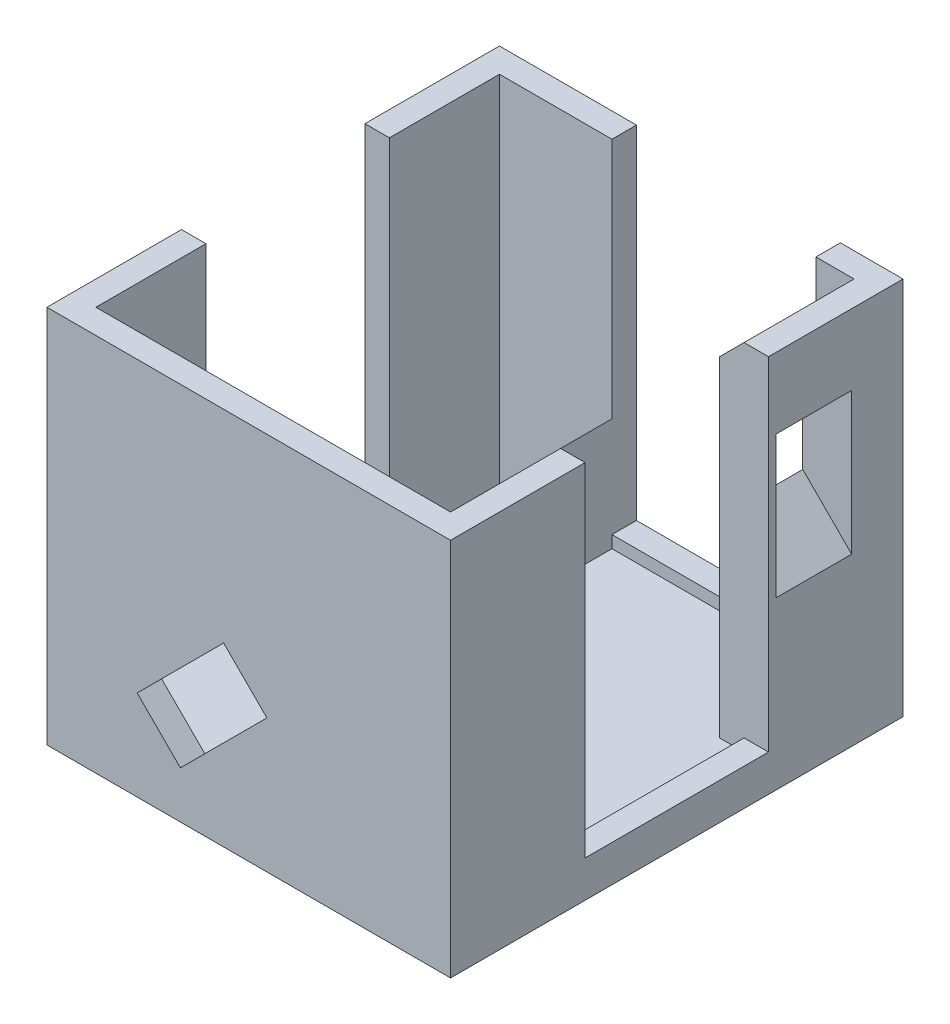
from build123d import *

# Parameters (mm, degrees)
SKETCH1_W               = 66
SKETCH1_H               = 74
SKETCH1_W_2             = 58
SKETCH1_H_2             = 66
BOSS_EXTRUDE1_DEPTH     = 58
SKETCH2_W               = 66
SKETCH2_H               = 74
BOSS_EXTRUDE2_DEPTH     = 4
BOSS_EXTRUDE4_DEPTH     = 70
SKETCH9_W               = 12.4
SKETCH9_H               = 16.4
CUT_EXTRUDE3_DEPTH      = 30
CUT_EXTRUDE7_DEPTH      = 5
CUT_EXTRUDE2_DEPTH      = 70
SKETCH12_W              = 4
SKETCH12_H              = 30
CUT_EXTRUDE8_DEPTH      = 56
SKETCH15_R              = 10
BOSS_EXTRUDE5_DEPTH     = 18.4
CUT_EXTRUDE9_DEPTH      = 18.4
CUT_EXTRUDE9_DEPTH_BACK = 4
SKETCH16_W              = 33.354899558
SKETCH16_H              = 4
CUT_EXTRUDE10_DEPTH     = 56


with BuildPart() as part:
    # Sketch1 → Boss-Extrude1 (new body)
    with BuildSketch(Plane(origin=(0, 0, 0), x_dir=(1, 0, 0), z_dir=(0, 1, 0))):
        Rectangle(SKETCH1_W, SKETCH1_H)
        Rectangle(SKETCH1_W_2, SKETCH1_H_2, mode=Mode.SUBTRACT)
    extrude(amount=BOSS_EXTRUDE1_DEPTH)

    # Sketch2 → Boss-Extrude2 (add)
    with BuildSketch(Plane.XZ):
        Rectangle(SKETCH2_W, SKETCH2_H)
    extrude(amount=BOSS_EXTRUDE2_DEPTH)

    # Sketch7 → Boss-Extrude4 (add)
    with BuildSketch(Plane.XY.offset(37)):
        Polygon((-29, 0), (29, 0), (29, 58), align=None)
    extrude(amount=-BOSS_EXTRUDE4_DEPTH)

    # Sketch9 → Cut-Extrude3 (cut)
    with BuildSketch(Plane(origin=(-14.5, 14.5, 0), x_dir=(0, 0, 1), z_dir=(-0.7071067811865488, 0.7071067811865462, 0))):
        with Locations((-22.4, 47.95930898)):
            Rectangle(SKETCH9_W, SKETCH9_H)
    extrude(amount=-CUT_EXTRUDE3_DEPTH, mode=Mode.SUBTRACT)

    # Sketch11 → Cut-Extrude7 (cut)
    with BuildSketch(Plane.XY.offset(37)):
        Polygon((-18.251976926, 10.748023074), (-4.109841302, 24.890158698), (2.96122651, 17.819090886), (-11.180909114, 3.676955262), align=None)
    extrude(amount=-CUT_EXTRUDE7_DEPTH, mode=Mode.SUBTRACT)

    # Sketch8 → Cut-Extrude2 (cut)
    with BuildSketch(Plane(origin=(0, 0, 0), x_dir=(1, 0, 0), z_dir=(0, 1, 0))):
        Polygon((-29, -27), (-26.2, -27), (-26.2, -33), (25, -33), (25, -15), (29, -15), (29, 15), (25, 15), (25, 33), (-10.6, 33), (-10.6, 21), (-29, 21), align=None)
    extrude(amount=CUT_EXTRUDE2_DEPTH, mode=Mode.SUBTRACT)

    # Sketch12 → Cut-Extrude8 (cut)
    with BuildSketch(Plane(origin=(0, 58, 0), x_dir=(1, 0, 0), z_dir=(0, 1, 0))):
        with Locations((31, 0)):
            Rectangle(SKETCH12_W, SKETCH12_H)
        with Locations((-31, 0)):
            Rectangle(SKETCH12_W, SKETCH12_H)
    extrude(amount=-CUT_EXTRUDE8_DEPTH, mode=Mode.SUBTRACT)

    # Sketch15 → Boss-Extrude5 (add)
    with BuildSketch(Plane(origin=(0, 0, 0), x_dir=(1, 0, 0), z_dir=(0, 1, 0))):
        with Locations(Location((0, 0, 0), (0, 0, 90))):
            Circle(SKETCH15_R)
    extrude(amount=BOSS_EXTRUDE5_DEPTH)

    # Sketch14 → Cut-Extrude9 (cut, two sides: drawn at the far end of the back side and taken through both)
    with BuildSketch(Plane(origin=(0, 0, 0), x_dir=(1, 0, 0), z_dir=(0, 1, 0)).offset(-CUT_EXTRUDE9_DEPTH_BACK)):
        with BuildLine():
            Line((2.23, -1.609223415), (2.23, 1.609223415))
            ThreePointArc((2.23, 1.609223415), (-2.75, 0), (2.23, -1.609223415))
        make_face()
    extrude(amount=CUT_EXTRUDE9_DEPTH + CUT_EXTRUDE9_DEPTH_BACK, mode=Mode.SUBTRACT)

    # Sketch16 → Cut-Extrude10 (cut)
    with BuildSketch(Plane(origin=(0, 58, 0), x_dir=(1, 0, 0), z_dir=(0, 1, 0))):
        with Locations((6.077449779, 35)):
            Rectangle(SKETCH16_W, SKETCH16_H)
    extrude(amount=-CUT_EXTRUDE10_DEPTH, mode=Mode.SUBTRACT)


solid = part.part
